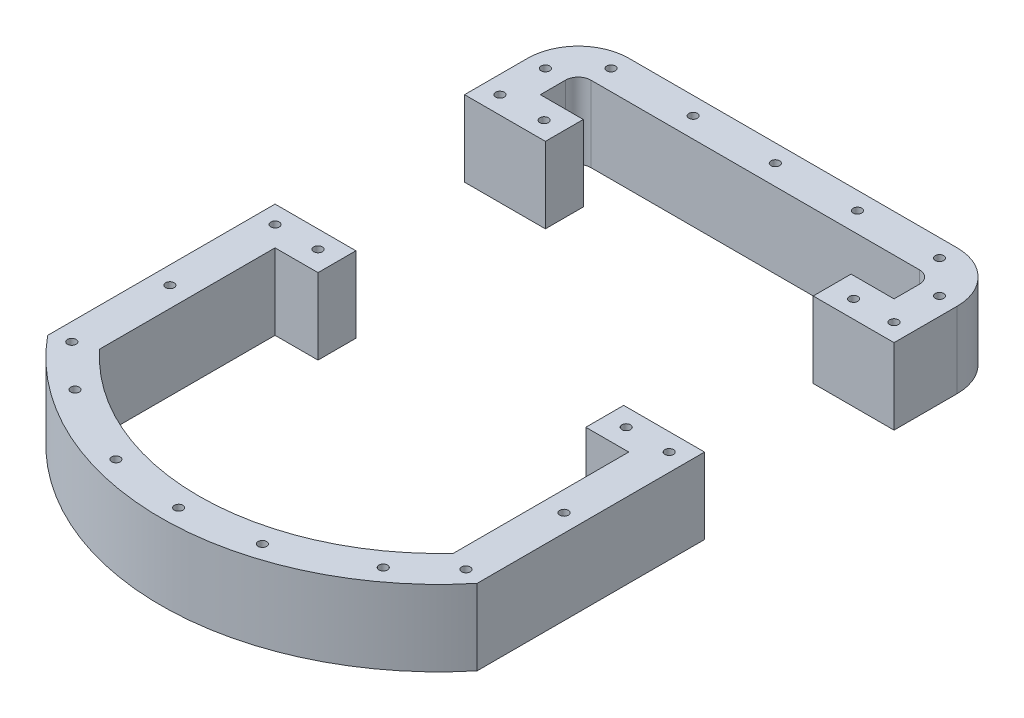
from build123d import *

# Parameters (mm, degrees)
BOSS_EXTRUDE1_DEPTH = 30
CUT_EXTRUDE1_REACH  = 172.734
SKETCH10_W          = 15
SKETCH10_H          = 75
SKETCH11_R          = 1.7
CUT_EXTRUDE3_DEPTH  = 32


with BuildPart() as part:
    # Sketch1 → Boss-Extrude1 (new body)
    with BuildSketch(Plane(origin=(0, 0, 0), x_dir=(1, 0, 0), z_dir=(0, 1, 0))):
        with BuildLine():
            Line((-65, 145), (65, 145))
            ThreePointArc((65, 145), (79.142135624, 139.142135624), (85, 125))
            Line((85, 125), (85, 100))
            Line((85, 100), (68, 100))
            Line((68, 100), (68, 25))
            Line((68, 25), (85, 25))
            Line((85, 25), (85, -65))
            ThreePointArc((85, -65), (0, -105.178799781), (-85, -65))
            Line((-85, -65), (-85, 25))
            Line((-85, 25), (-68, 25))
            Line((-68, 25), (-68, 100))
            Line((-68, 100), (-85, 100))
            Line((-85, 100), (-85, 125))
            ThreePointArc((-85, 125), (-79.142135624, 139.142135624), (-65, 145))
        make_face()
        with BuildLine():
            Line((-65, 130), (65, 130))
            ThreePointArc((65, 130), (68.535533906, 128.535533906), (70, 125))
            Line((70, 125), (70, 115))
            Line((70, 115), (53, 115))
            Line((53, 115), (53, 10))
            Line((53, 10), (70, 10))
            Line((70, 10), (70, -59.404962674))
            ThreePointArc((70, -59.404962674), (0, -90.178799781), (-70, -59.404962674))
            Line((-70, -59.404962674), (-70, 10))
            Line((-70, 10), (-53, 10))
            Line((-53, 10), (-53, 115))
            Line((-53, 115), (-70, 115))
            Line((-70, 115), (-70, 125))
            ThreePointArc((-70, 125), (-68.535533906, 128.535533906), (-65, 130))
        make_face(mode=Mode.SUBTRACT)
    extrude(amount=BOSS_EXTRUDE1_DEPTH)

    # Sketch10 → Cut-Extrude1 (cut, up to next)
    with BuildSketch(Plane(origin=(0, 30, 0), x_dir=(1, 0, 0), z_dir=(0, 1, 0)), mode=Mode.PRIVATE) as cut_extrude1_sk1:
        with Locations((60.5, 62.5)):
            Rectangle(SKETCH10_W, SKETCH10_H)
    cut_extrude1_tool1 = extrude(cut_extrude1_sk1.sketch, amount=-CUT_EXTRUDE1_REACH, mode=Mode.PRIVATE) & part.part
    # Sketch10 → Cut-Extrude1 (cut, up to next)
    with BuildSketch(Plane(origin=(0, 30, 0), x_dir=(1, 0, 0), z_dir=(0, 1, 0)), mode=Mode.PRIVATE) as cut_extrude1_sk2:
        with Locations((-60.5, 62.5)):
            Rectangle(SKETCH10_W, SKETCH10_H)
    cut_extrude1_tool2 = extrude(cut_extrude1_sk2.sketch, amount=-CUT_EXTRUDE1_REACH, mode=Mode.PRIVATE) & part.part
    add(cut_extrude1_tool1.solids().sort_by_distance((60.5, 30, -62.5))[0], mode=Mode.SUBTRACT)
    add(cut_extrude1_tool2.solids().sort_by_distance((-60.5, 30, -62.5))[0], mode=Mode.SUBTRACT)


with BuildPart() as cut_extrude1_piece_1:
    # of the separate pieces the step leaves, piece 1, a body of its own (cut_extrude1_pieces)
    add(part.part.solids().sort_by_distance((-85, 0, -25))[0])


with BuildPart() as cut_extrude1_piece_2:
    # of the separate pieces the step leaves, piece 2, a body of its own (cut_extrude1_pieces)
    add(part.part.solids().sort_by_distance((-85, 0, -100))[0])


with BuildPart() as cut_extrude3_tool:
    # Sketch11 → Cut-Extrude3 (new body)
    with BuildSketch(Plane(origin=(0, 30, 0), x_dir=(1, 0, 0), z_dir=(0, 1, 0))):
        with Locations(Location((-60.5, 107, 0), (0, 0, 270))):
            Circle(SKETCH11_R)
        with Locations(Location((-78, 125, 0), (0, 0, 270))):
            Circle(SKETCH11_R)
        with Locations(Location((-65, 138, 0), (0, 0, 270))):
            Circle(SKETCH11_R)
        with Locations(Location((-32.5, 138, 0), (0, 0, 270))):
            Circle(SKETCH11_R)
        with Locations(Location((32.5, 138, 0), (0, 0, 270))):
            Circle(SKETCH11_R)
        with Locations(Location((65, 138, 0), (0, 0, 270))):
            Circle(SKETCH11_R)
        with Locations(Location((78, 125, 0), (0, 0, 270))):
            Circle(SKETCH11_R)
        with Locations(Location((78, 107, 0), (0, 0, 270))):
            Circle(SKETCH11_R)
        with Locations(Location((62, 107, 0), (0, 0, 270))):
            Circle(SKETCH11_R)
        with Locations(Location((-78, 107, 0), (0, 0, 270))):
            Circle(SKETCH11_R)
        with Locations(Location((0, 138, 0), (0, 0, 270))):
            Circle(SKETCH11_R)
        with Locations(Location((-78, 18, 0), (0, 0, 270))):
            Circle(SKETCH11_R)
        with Locations(Location((-61, 18, 0), (0, 0, 270))):
            Circle(SKETCH11_R)
        with Locations(Location((-78, -23.62, 0), (0, 0, 270))):
            Circle(SKETCH11_R)
        with Locations(Location((-78, -62.446920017, 0), (0, 0, 270))):
            Circle(SKETCH11_R)
        with Locations(Location((-61, -78.172775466, 0), (0, 0, 270))):
            Circle(SKETCH11_R)
        with Locations(Location((0, -98.178799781, 0), (0, 0, 270))):
            Circle(SKETCH11_R)
        with Locations(Location((-29, -94.011992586, 0), (0, 0, 270))):
            Circle(SKETCH11_R)
        with Locations(Location((61, 18, 0), (0, 0, 90))):
            Circle(SKETCH11_R)
        with Locations(Location((78, 18, 0), (0, 0, 90))):
            Circle(SKETCH11_R)
        with Locations(Location((78, -23.62, 0), (0, 0, 90))):
            Circle(SKETCH11_R)
        with Locations(Location((78, -62.446920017, 0), (0, 0, 90))):
            Circle(SKETCH11_R)
        with Locations(Location((61, -78.172775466, 0), (0, 0, 90))):
            Circle(SKETCH11_R)
        with Locations(Location((29, -94.011992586, 0), (0, 0, 90))):
            Circle(SKETCH11_R)
    extrude(amount=-CUT_EXTRUDE3_DEPTH)


with BuildPart() as cut_extrude1_piece_1_1:
    add(cut_extrude1_piece_1.part)

    # Cut-Extrude3: cut by cut_extrude3_tool
    add(cut_extrude3_tool.part, mode=Mode.SUBTRACT)


with BuildPart() as cut_extrude1_piece_2_1:
    add(cut_extrude1_piece_2.part)

    # Cut-Extrude3: cut by cut_extrude3_tool
    add(cut_extrude3_tool.part, mode=Mode.SUBTRACT)


solid = Compound([cut_extrude1_piece_1_1.part, cut_extrude1_piece_2_1.part])
